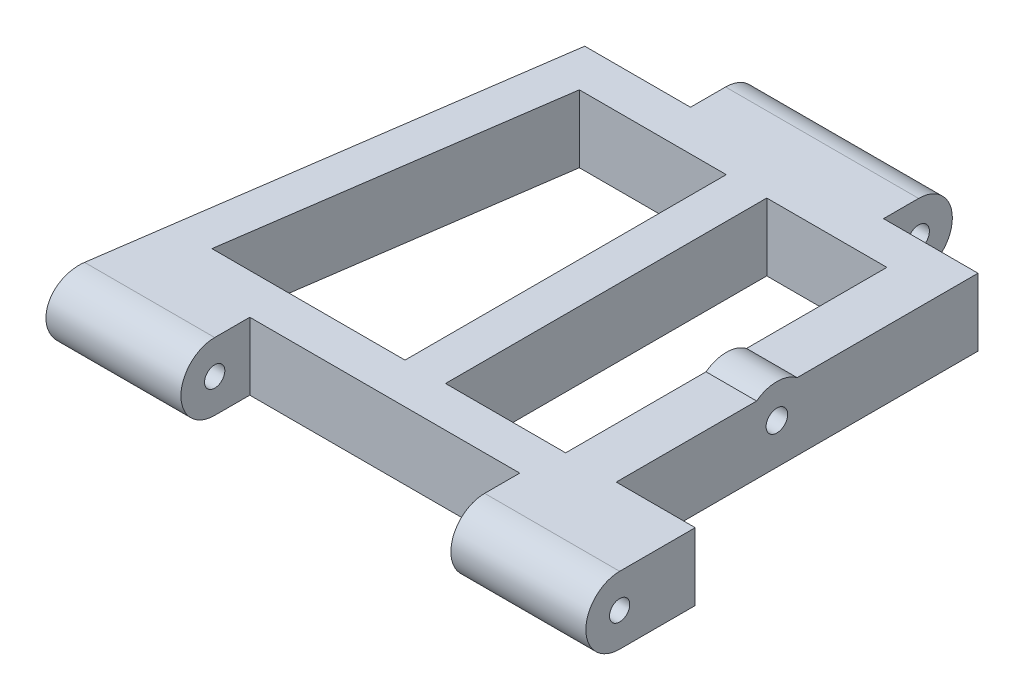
from build123d import *

# Parameters (mm, degrees)
SKETCH_1_W               = 3
SKETCH_1_H               = 6
SKETCH_1_W_2             = 7.5
SKETCH_1_H_2             = 47.6
EXTRUDE_1_DEPTH          = 10
SKETCH_2_R               = 1.6
CUT_EXTRUDE_1_DEPTH      = 28.6
CUT_EXTRUDE_2_DEPTH      = 123.883690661
CUT_EXTRUDE_2_DEPTH_BACK = 123.883690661
SKETCH_3_R               = 1.5
EXTRUDE_2_DEPTH          = 7.5
CUT_EXTRUDE_3_DEPTH      = 10


with BuildPart() as part:
    # Sketch 1 → Extrude 1 (new body)
    with BuildSketch(Plane(origin=(0, 0, 0), x_dir=(1, 0, 0), z_dir=(0, 1, 0))):
        Polygon((-128.03752184, 90.119148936), (-128.03752184, 96.119148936), (-129.50377184, 96.119148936), (-130.36627184, 90.119148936), align=None)
        Polygon((-124.304596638, 90.119148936), (-123.442096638, 96.119148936), (-127.83752184, 96.119148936), (-128.03752184, 96.119148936), (-128.03752184, 90.119148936), align=None)
        Polygon((-102.53752184, 96.119148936), (-113.83752184, 96.119148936), (-123.442096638, 96.119148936), (-124.304596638, 90.119148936), (-102.53752184, 90.119148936), align=None)
        Polygon((-113.83752184, 106.319148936), (-113.83752184, 96.119148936), (-102.53752184, 96.119148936), (-99.53752184, 96.119148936), (-99.53752184, 106.319148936), align=None)
        Polygon((-99.53752184, 106.319148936), (-99.53752184, 96.119148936), (-96.53752184, 96.119148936), (-85.23752184, 96.119148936), (-85.23752184, 106.319148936), align=None)
        with Locations((-98.03752184, 93.119148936)):
            Rectangle(SKETCH_1_W, SKETCH_1_H)
        with Locations((-101.03752184, 93.119148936)):
            Rectangle(SKETCH_1_W, SKETCH_1_H)
        Polygon((-99.53752184, 90.119148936), (-102.53752184, 90.119148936), (-102.53752184, 42.519148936), (-99.53752184, 42.519148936), (-99.53752184, 47.377424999), align=None)
        Polygon((-96.53752184, 90.119148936), (-99.53752184, 90.119148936), (-99.53752184, 47.377424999), (-99.53752184, 42.519148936), (-96.53752184, 42.519148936), align=None)
        Polygon((-85.23752184, 96.119148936), (-96.53752184, 96.119148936), (-96.53752184, 90.119148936), (-78.73752184, 90.119148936), (-71.23752184, 90.119148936), (-71.23752184, 96.119148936), align=None)
        with Locations((-74.98752184, 66.319148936)):
            Rectangle(SKETCH_1_W_2, SKETCH_1_H_2)
        Polygon((-128.03752184, 64.150973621), (-124.304596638, 90.119148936), (-128.03752184, 90.119148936), align=None)
        Polygon((-128.03752184, 64.150973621), (-128.03752184, 90.119148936), (-130.36627184, 90.119148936), (-137.20877184, 42.519148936), (-131.147096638, 42.519148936), align=None)
        Polygon((-133.475846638, 26.319148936), (-131.147096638, 42.519148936), (-137.20877184, 42.519148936), (-139.53752184, 26.319148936), align=None)
        Polygon((-128.03752184, 26.319148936), (-128.03752184, 42.519148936), (-131.147096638, 42.519148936), (-133.475846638, 26.319148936), align=None)
        Polygon((-99.53752184, 42.519148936), (-102.53752184, 42.519148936), (-128.03752184, 42.519148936), (-128.03752184, 26.319148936), (-119.53752184, 26.319148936), (-119.53752184, 36.519148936), (-99.53752184, 36.519148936), align=None)
        Polygon((-96.53752184, 42.519148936), (-99.53752184, 42.519148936), (-99.53752184, 36.519148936), (-79.53752184, 36.519148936), (-79.53752184, 26.319148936), (-71.03752184, 26.319148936), (-59.53752184, 26.319148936), (-59.53752184, 42.519148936), (-71.23752184, 42.519148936), (-78.73752184, 42.519148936), align=None)
    extrude(amount=EXTRUDE_1_DEPTH)

    # Sketch 2 → Cut-Extrude 1 (cut)
    with BuildSketch(Plane.ZY.offset(113.83752184)):
        with Locations((-101.319148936, 5)):
            Circle(SKETCH_2_R)
        with BuildLine():
            Line((-106.319148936, 10), (-106.319148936, 5))
            ThreePointArc((-106.319148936, 5), (-104.854682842, 8.535533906), (-101.319148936, 10))
            Line((-101.319148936, 10), (-106.319148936, 10))
        make_face()
        with BuildLine():
            Line((-106.319148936, 5), (-106.319148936, 0))
            Line((-106.319148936, 0), (-101.319148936, 0))
            ThreePointArc((-101.319148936, 0), (-104.854682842, 1.464466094), (-106.319148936, 5))
        make_face()
    extrude(amount=-CUT_EXTRUDE_1_DEPTH, mode=Mode.SUBTRACT)

    # Sketch 3 → Cut-Extrude 2 (cut, two sides: drawn at the far end of the back side and taken through both)
    with BuildSketch(Plane.ZY.offset(78.73752184).offset(-CUT_EXTRUDE_2_DEPTH_BACK)):
        with Locations((-31.319148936, 5)):
            Circle(SKETCH_3_R)
        with BuildLine():
            Line((-26.319148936, 10), (-31.319148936, 10))
            ThreePointArc((-31.319148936, 10), (-27.78361503, 8.535533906), (-26.319148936, 5))
            Line((-26.319148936, 5), (-26.319148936, 10))
        make_face()
        with BuildLine():
            ThreePointArc((-26.319148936, 5), (-27.78361503, 1.464466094), (-31.319148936, 0))
            Line((-31.319148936, 0), (-26.319148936, 0))
            Line((-26.319148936, 0), (-26.319148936, 5))
        make_face()
    extrude(amount=CUT_EXTRUDE_2_DEPTH + CUT_EXTRUDE_2_DEPTH_BACK, mode=Mode.SUBTRACT)

    # Sketch 4 → Extrude 2 (add)
    with BuildSketch(Plane.ZY.offset(78.73752184)):
        with BuildLine():
            ThreePointArc((-63.319148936, 10), (-64.738010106, 10.74341649), (-66.319148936, 11))
            Line((-66.319148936, 11), (-66.319148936, 10))
            Line((-66.319148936, 10), (-63.319148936, 10))
        make_face()
        with BuildLine():
            Line((-66.319148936, 10), (-66.319148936, 11))
            ThreePointArc((-66.319148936, 11), (-67.900287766, 10.74341649), (-69.319148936, 10))
            Line((-69.319148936, 10), (-66.319148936, 10))
        make_face()
        with BuildLine():
            ThreePointArc((-63.319148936, 10), (-64.738010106, 10.74341649), (-66.319148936, 11))
            Line((-66.319148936, 11), (-66.319148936, 10))
            Line((-66.319148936, 10), (-63.319148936, 10))
        make_face()
        with BuildLine():
            Line((-66.319148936, 10), (-66.319148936, 11))
            ThreePointArc((-66.319148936, 11), (-67.900287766, 10.74341649), (-69.319148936, 10))
            Line((-69.319148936, 10), (-66.319148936, 10))
        make_face()
    extrude(amount=-EXTRUDE_2_DEPTH)

    # Sketch 4_3 → Cut-Extrude 3 (cut)
    with BuildSketch(Plane.ZY.offset(78.73752184)):
        with BuildLine():
            ThreePointArc((-64.719148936, 6), (-65.187778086, 7.13137085), (-66.319148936, 7.6))
            Line((-66.319148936, 7.6), (-66.319148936, 4.4))
            ThreePointArc((-66.319148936, 4.4), (-65.187778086, 4.86862915), (-64.719148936, 6))
        make_face()
        with BuildLine():
            Line((-66.319148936, 4.4), (-66.319148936, 7.6))
            ThreePointArc((-66.319148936, 7.6), (-67.919148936, 6), (-66.319148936, 4.4))
        make_face()
        with BuildLine():
            ThreePointArc((-64.719148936, 6), (-65.187778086, 7.13137085), (-66.319148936, 7.6))
            Line((-66.319148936, 7.6), (-66.319148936, 4.4))
            ThreePointArc((-66.319148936, 4.4), (-65.187778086, 4.86862915), (-64.719148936, 6))
        make_face()
        with BuildLine():
            Line((-66.319148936, 4.4), (-66.319148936, 7.6))
            ThreePointArc((-66.319148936, 7.6), (-67.919148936, 6), (-66.319148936, 4.4))
        make_face()
    extrude(amount=-CUT_EXTRUDE_3_DEPTH, mode=Mode.SUBTRACT)


solid = part.part
